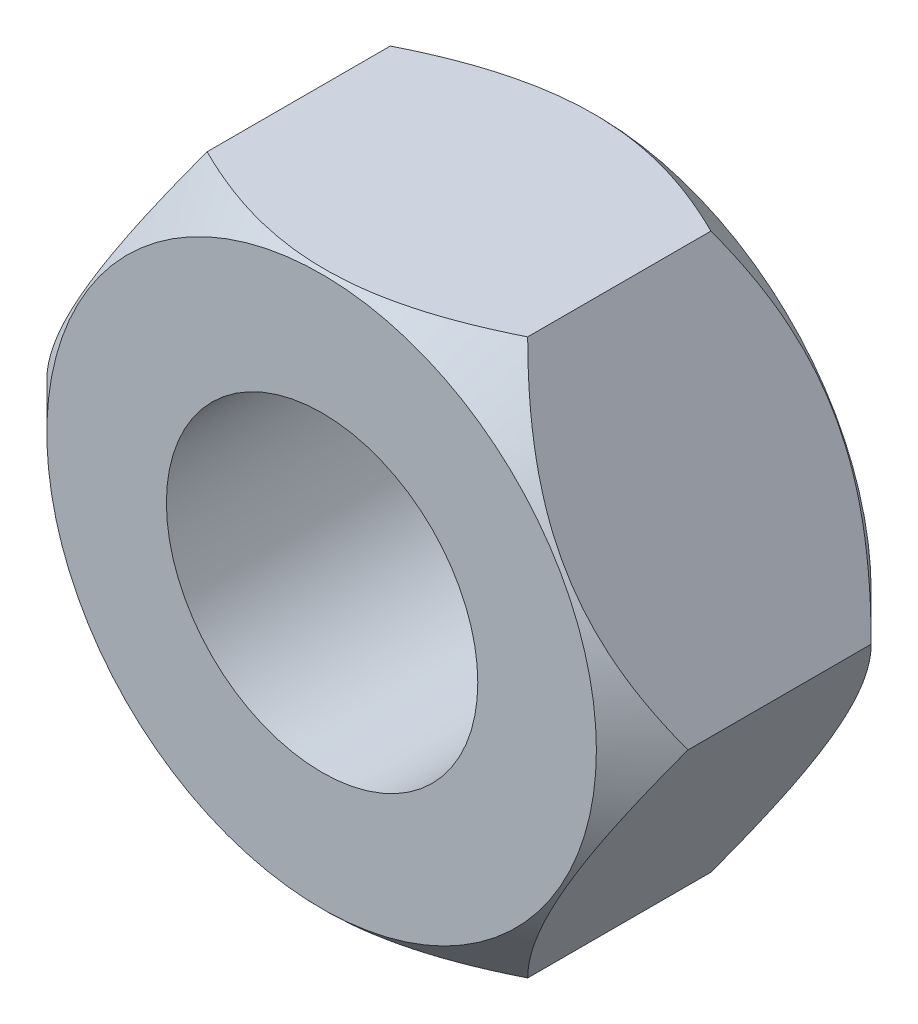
ISO-10303-21;
HEADER;
FILE_DESCRIPTION(('STEP AP214'),'2;1');
FILE_NAME('part.step','',(''),(''),'','','');
FILE_SCHEMA(('AUTOMOTIVE_DESIGN { 1 0 10303 214 1 1 1 1 }'));
ENDSEC;
DATA;
#1=APPLICATION_CONTEXT('core data for automotive mechanical design processes');
#2=APPLICATION_PROTOCOL_DEFINITION('international standard','automotive_design',2000,#1);
#3=PRODUCT_CONTEXT('',#1,'mechanical');
#4=PRODUCT('Part','Part','',(#3));
#5=PRODUCT_RELATED_PRODUCT_CATEGORY('part','',(#4));
#6=PRODUCT_DEFINITION_FORMATION('','',#4);
#7=PRODUCT_DEFINITION_CONTEXT('part definition',#1,'design');
#8=PRODUCT_DEFINITION('design','',#6,#7);
#9=PRODUCT_DEFINITION_SHAPE('','',#8);
#10=(LENGTH_UNIT() NAMED_UNIT(*) SI_UNIT(.MILLI.,.METRE.));
#11=(NAMED_UNIT(*) PLANE_ANGLE_UNIT() SI_UNIT($,.RADIAN.));
#12=(NAMED_UNIT(*) SI_UNIT($,.STERADIAN.) SOLID_ANGLE_UNIT());
#13=UNCERTAINTY_MEASURE_WITH_UNIT(LENGTH_MEASURE(1.E-05),#10,'distance_accuracy_value','');
#14=(GEOMETRIC_REPRESENTATION_CONTEXT(3) GLOBAL_UNCERTAINTY_ASSIGNED_CONTEXT((#13)) GLOBAL_UNIT_ASSIGNED_CONTEXT((#10,
#11,#12)) REPRESENTATION_CONTEXT('',''));
#15=CARTESIAN_POINT('',(0.,0.,0.));
#16=DIRECTION('',(0.,0.,1.));
#17=DIRECTION('',(1.,0.,0.));
#18=AXIS2_PLACEMENT_3D('',#15,#16,#17);
#19=CARTESIAN_POINT('',(0.,0.,1.));
#20=DIRECTION('',(0.,0.,1.));
#21=DIRECTION('',(1.,0.,0.));
#22=AXIS2_PLACEMENT_3D('',#19,#20,#21);
#23=CONICAL_SURFACE('',#22,7.,0.78539816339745);
#24=CARTESIAN_POINT('',(0.,0.,0.));
#25=DIRECTION('',(0.,0.,1.));
#26=DIRECTION('',(1.,0.,0.));
#27=AXIS2_PLACEMENT_3D('',#24,#25,#26);
#28=CIRCLE('',#27,5.99999999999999);
#29=CARTESIAN_POINT('',(5.99999999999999,0.,0.));
#30=VERTEX_POINT('',#29);
#31=EDGE_CURVE('E210',#30,#30,#28,.F.);
#32=ORIENTED_EDGE('',*,*,#31,.F.);
#33=EDGE_LOOP('',(#32));
#34=FACE_BOUND('',#33,.T.);
#35=CARTESIAN_POINT('',(3.49988452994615,6.06237782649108,1.00011547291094));
#36=CARTESIAN_POINT('',(3.56006472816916,5.95814266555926,0.93994132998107));
#37=CARTESIAN_POINT('',(3.62070750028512,5.85310630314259,0.881613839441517));
#38=CARTESIAN_POINT('',(3.74300894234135,5.64127399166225,0.769213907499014));
#39=CARTESIAN_POINT('',(3.80466814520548,5.53447711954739,0.715143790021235));
#40=CARTESIAN_POINT('',(3.99187934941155,5.21021780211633,0.559701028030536));
#41=CARTESIAN_POINT('',(4.1190161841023,4.99001034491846,0.465759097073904));
#42=CARTESIAN_POINT('',(4.37539777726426,4.54594439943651,0.304890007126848));
#43=CARTESIAN_POINT('',(4.5045770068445,4.32219941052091,0.237557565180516));
#44=CARTESIAN_POINT('',(4.70046959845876,3.98290348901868,0.159670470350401));
#45=CARTESIAN_POINT('',(4.76605553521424,3.86930531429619,0.137570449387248));
#46=CARTESIAN_POINT('',(4.89778273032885,3.64114711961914,0.10157436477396));
#47=CARTESIAN_POINT('',(4.96392390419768,3.52658724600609,0.0876770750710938));
#48=CARTESIAN_POINT('',(5.1251007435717,3.24742077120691,0.0643762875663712));
#49=CARTESIAN_POINT('',(5.22031007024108,3.08251338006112,0.0594873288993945));
#50=CARTESIAN_POINT('',(5.41055712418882,2.75299581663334,0.0676930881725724));
#51=CARTESIAN_POINT('',(5.50559477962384,2.58838576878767,0.0807941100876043));
#52=CARTESIAN_POINT('',(5.69477409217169,2.26071758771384,0.124207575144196));
#53=CARTESIAN_POINT('',(5.78891462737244,2.09766139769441,0.154539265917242));
#54=CARTESIAN_POINT('',(5.97557765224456,1.77435155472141,0.230765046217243));
#55=CARTESIAN_POINT('',(6.06810026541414,1.61409768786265,0.276657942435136));
#56=CARTESIAN_POINT('',(6.2323446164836,1.32961812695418,0.371073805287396));
#57=CARTESIAN_POINT('',(6.30443003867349,1.20476251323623,0.41711368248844));
#58=CARTESIAN_POINT('',(6.447306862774,0.957292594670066,0.516612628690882));
#59=CARTESIAN_POINT('',(6.51809822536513,0.834678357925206,0.57007192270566));
#60=CARTESIAN_POINT('',(6.65816396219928,0.592077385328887,0.683211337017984));
#61=CARTESIAN_POINT('',(6.72744231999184,0.472083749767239,0.742871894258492));
#62=CARTESIAN_POINT('',(6.86471619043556,0.23431843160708,0.867630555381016));
#63=CARTESIAN_POINT('',(6.93271245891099,0.116545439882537,0.93272532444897));
#64=CARTESIAN_POINT('',(7.00011547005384,-0.000200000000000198,1.00011547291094));
#65=B_SPLINE_CURVE_WITH_KNOTS('',3,(#35,#36,#37,#38,#39,#40,#41,#42,#43,#44,#45,#46,#47,#48,#49,
#50,#51,#52,#53,#54,#55,#56,#57,#58,#59,#60,#61,#62,#63,#64),.UNSPECIFIED.,.F.,.F.,(4,2,2,2,2,2,
2,2,2,2,2,2,2,2,4),(0.,0.403669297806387,0.807557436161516,1.61969420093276,2.41893497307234,
2.81777152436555,3.21654844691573,3.78710477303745,4.35786108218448,4.92925621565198,
5.50060754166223,5.95442549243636,6.40825720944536,6.8606983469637,7.31286384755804),.UNSPECIFIED.);
#66=CARTESIAN_POINT('',(3.49999999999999,6.06217782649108,1.));
#67=VERTEX_POINT('',#66);
#68=CARTESIAN_POINT('',(7.,0.,1.));
#69=VERTEX_POINT('',#68);
#70=EDGE_CURVE('E87',#67,#69,#65,.T.);
#71=ORIENTED_EDGE('',*,*,#70,.T.);
#72=CARTESIAN_POINT('',(7.00011547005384,0.0002,1.00011547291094));
#73=CARTESIAN_POINT('',(6.93993527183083,-0.104035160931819,0.939941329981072));
#74=CARTESIAN_POINT('',(6.87929249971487,-0.209071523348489,0.88161383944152));
#75=CARTESIAN_POINT('',(6.75699105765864,-0.420903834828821,0.76921390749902));
#76=CARTESIAN_POINT('',(6.69533185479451,-0.527700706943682,0.715143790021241));
#77=CARTESIAN_POINT('',(6.50812065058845,-0.851960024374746,0.559701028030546));
#78=CARTESIAN_POINT('',(6.3809838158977,-1.07216748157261,0.465759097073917));
#79=CARTESIAN_POINT('',(6.12460222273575,-1.51623342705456,0.304890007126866));
#80=CARTESIAN_POINT('',(5.99542299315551,-1.73997841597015,0.237557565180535));
#81=CARTESIAN_POINT('',(5.79953040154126,-2.07927433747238,0.159670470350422));
#82=CARTESIAN_POINT('',(5.73394446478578,-2.19287251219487,0.137570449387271));
#83=CARTESIAN_POINT('',(5.60221726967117,-2.42103070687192,0.101574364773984));
#84=CARTESIAN_POINT('',(5.53607609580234,-2.53559058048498,0.087677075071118));
#85=CARTESIAN_POINT('',(5.37489925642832,-2.81475705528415,0.0643762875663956));
#86=CARTESIAN_POINT('',(5.27968992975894,-2.97966444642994,0.0594873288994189));
#87=CARTESIAN_POINT('',(5.0894428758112,-3.30918200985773,0.0676930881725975));
#88=CARTESIAN_POINT('',(4.99440522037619,-3.4737920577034,0.0807941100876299));
#89=CARTESIAN_POINT('',(4.80522590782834,-3.80146023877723,0.124207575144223));
#90=CARTESIAN_POINT('',(4.71108537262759,-3.96451642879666,0.154539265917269));
#91=CARTESIAN_POINT('',(4.52442234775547,-4.28782627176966,0.230765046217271));
#92=CARTESIAN_POINT('',(4.43189973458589,-4.44808013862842,0.276657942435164));
#93=CARTESIAN_POINT('',(4.26765538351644,-4.73255969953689,0.371073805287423));
#94=CARTESIAN_POINT('',(4.19556996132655,-4.85741531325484,0.417113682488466));
#95=CARTESIAN_POINT('',(4.05269313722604,-5.10488523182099,0.516612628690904));
#96=CARTESIAN_POINT('',(3.98190177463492,-5.22749946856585,0.57007192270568));
#97=CARTESIAN_POINT('',(3.84183603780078,-5.47010044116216,0.683211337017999));
#98=CARTESIAN_POINT('',(3.77255768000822,-5.59009407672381,0.742871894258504));
#99=CARTESIAN_POINT('',(3.6352838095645,-5.82785939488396,0.867630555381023));
#100=CARTESIAN_POINT('',(3.56728754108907,-5.9456323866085,0.932725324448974));
#101=CARTESIAN_POINT('',(3.49988452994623,-6.06237782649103,1.00011547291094));
#102=B_SPLINE_CURVE_WITH_KNOTS('',3,(#72,#73,#74,#75,#76,#77,#78,#79,#80,#81,#82,#83,#84,#85,
#86,#87,#88,#89,#90,#91,#92,#93,#94,#95,#96,#97,#98,#99,#100,#101),.UNSPECIFIED.,.F.,.F.,(4,2,2,
2,2,2,2,2,2,2,2,2,2,2,4),(0.,0.403669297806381,0.807557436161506,1.61969420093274,
2.41893497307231,2.81777152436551,3.21654844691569,3.78710477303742,4.35786108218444,
4.92925621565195,5.5006075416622,5.95442549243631,6.4082572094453,6.86069834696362,
7.31286384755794),.UNSPECIFIED.);
#103=CARTESIAN_POINT('',(3.50000000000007,-6.06217782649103,1.));
#104=VERTEX_POINT('',#103);
#105=EDGE_CURVE('E176',#69,#104,#102,.T.);
#106=ORIENTED_EDGE('',*,*,#105,.T.);
#107=CARTESIAN_POINT('',(-7.27913594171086,-6.06217782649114,3.47289924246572));
#108=CARTESIAN_POINT('',(-7.10317834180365,-6.06217782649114,3.33772084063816));
#109=CARTESIAN_POINT('',(-6.92626980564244,-6.06217782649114,3.2037607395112));
#110=CARTESIAN_POINT('',(-6.57016320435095,-6.06217782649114,2.93883289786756));
#111=CARTESIAN_POINT('',(-6.39096460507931,-6.06217782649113,2.80786587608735));
#112=CARTESIAN_POINT('',(-6.02858041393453,-6.06217782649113,2.54854786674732));
#113=CARTESIAN_POINT('',(-5.84537472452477,-6.06217782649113,2.42022487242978));
#114=CARTESIAN_POINT('',(-5.47590939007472,-6.06217782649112,2.16806840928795));
#115=CARTESIAN_POINT('',(-5.2896499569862,-6.06217782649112,2.04423463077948));
#116=CARTESIAN_POINT('',(-4.90173360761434,-6.06217782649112,1.79445897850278));
#117=CARTESIAN_POINT('',(-4.69984526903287,-6.06217782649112,1.66887471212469));
#118=CARTESIAN_POINT('',(-4.29132923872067,-6.06217782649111,1.4255354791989));
#119=CARTESIAN_POINT('',(-4.08470076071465,-6.06217782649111,1.30778182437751));
#120=CARTESIAN_POINT('',(-3.66665369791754,-6.06217782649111,1.08261412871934));
#121=CARTESIAN_POINT('',(-3.45525159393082,-6.0621778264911,0.975169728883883));
#122=CARTESIAN_POINT('',(-3.02648683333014,-6.0621778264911,0.773027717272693));
#123=CARTESIAN_POINT('',(-2.80912703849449,-6.0621778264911,0.678324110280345));
#124=CARTESIAN_POINT('',(-2.38945676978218,-6.06217782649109,0.513524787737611));
#125=CARTESIAN_POINT('',(-2.18774056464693,-6.06217782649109,0.441931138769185));
#126=CARTESIAN_POINT('',(-1.77919044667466,-6.06217782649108,0.314892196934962));
#127=CARTESIAN_POINT('',(-1.5723562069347,-6.06217782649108,0.259447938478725));
#128=CARTESIAN_POINT('',(-1.15839482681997,-6.06217782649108,0.168624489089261));
#129=CARTESIAN_POINT('',(-0.951348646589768,-6.06217782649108,0.132882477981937));
#130=CARTESIAN_POINT('',(-0.534711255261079,-6.06217782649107,0.0822054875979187));
#131=CARTESIAN_POINT('',(-0.325120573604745,-6.06217782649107,0.0672662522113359));
#132=CARTESIAN_POINT('',(0.0854359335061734,-6.06217782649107,0.0594550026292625));
#133=CARTESIAN_POINT('',(0.286384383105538,-6.06217782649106,0.0656601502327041));
#134=CARTESIAN_POINT('',(0.686701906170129,-6.06217782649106,0.0976821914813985));
#135=CARTESIAN_POINT('',(0.886070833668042,-6.06217782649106,0.12350087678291));
#136=CARTESIAN_POINT('',(1.28516440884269,-6.06217782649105,0.193732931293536));
#137=CARTESIAN_POINT('',(1.4848304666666,-6.06217782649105,0.238473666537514));
#138=CARTESIAN_POINT('',(1.87976956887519,-6.06217782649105,0.344075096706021));
#139=CARTESIAN_POINT('',(2.07504287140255,-6.06217782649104,0.40493484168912));
#140=CARTESIAN_POINT('',(2.47244793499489,-6.06217782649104,0.544179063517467));
#141=CARTESIAN_POINT('',(2.67428375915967,-6.06217782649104,0.623398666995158));
#142=CARTESIAN_POINT('',(3.07276063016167,-6.06217782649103,0.794072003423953));
#143=CARTESIAN_POINT('',(3.26939928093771,-6.06217782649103,0.885531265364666));
#144=CARTESIAN_POINT('',(3.65841256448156,-6.06217782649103,1.07851459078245));
#145=CARTESIAN_POINT('',(3.85077167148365,-6.06217782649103,1.18006969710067));
#146=CARTESIAN_POINT('',(4.23108086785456,-6.06217782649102,1.39100920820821));
#147=CARTESIAN_POINT('',(4.41903163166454,-6.06217782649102,1.50039240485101));
#148=CARTESIAN_POINT('',(4.78191124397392,-6.06217782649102,1.71989981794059));
#149=CARTESIAN_POINT('',(4.95702469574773,-6.06217782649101,1.82972046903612));
#150=CARTESIAN_POINT('',(5.30424313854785,-6.06217782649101,2.05403278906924));
#151=CARTESIAN_POINT('',(5.47634790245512,-6.06217782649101,2.16852480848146));
#152=CARTESIAN_POINT('',(5.81655805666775,-6.06217782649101,2.40041373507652));
#153=CARTESIAN_POINT('',(5.98468447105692,-6.062177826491,2.5177799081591));
#154=CARTESIAN_POINT('',(6.31863136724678,-6.062177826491,2.75565578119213));
#155=CARTESIAN_POINT('',(6.48445247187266,-6.062177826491,2.87616460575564));
#156=CARTESIAN_POINT('',(6.64930664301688,-6.062177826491,2.99795970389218));
#157=B_SPLINE_CURVE_WITH_KNOTS('',3,(#107,#108,#109,#110,#111,#112,#113,#114,#115,#116,#117,
#118,#119,#120,#121,#122,#123,#124,#125,#126,#127,#128,#129,#130,#131,#132,#133,#134,#135,#136,
#137,#138,#139,#140,#141,#142,#143,#144,#145,#146,#147,#148,#149,#150,#151,#152,#153,#154,#155,
#156),.UNSPECIFIED.,.F.,.F.,(4,2,2,2,2,2,2,2,2,2,2,2,2,2,2,2,2,2,2,2,2,2,2,2,4),(0.,
0.6656762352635,1.33151067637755,2.00248421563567,2.67341138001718,3.38655327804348,
4.09981433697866,4.81090598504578,5.52166184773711,6.16324135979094,6.80486195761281,
7.43423460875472,8.06347847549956,8.66561730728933,9.26781114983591,9.88087949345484,
10.4939117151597,11.1438903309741,11.7941635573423,12.4465020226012,13.0987400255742,
13.7187560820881,14.3388187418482,14.9538989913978,15.5688097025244),.UNSPECIFIED.);
#158=CARTESIAN_POINT('',(-3.49999999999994,-6.0621778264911,1.));
#159=VERTEX_POINT('',#158);
#160=EDGE_CURVE('E170',#104,#159,#157,.F.);
#161=ORIENTED_EDGE('',*,*,#160,.T.);
#162=CARTESIAN_POINT('',(-3.49988452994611,-6.0623778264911,1.00011547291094));
#163=CARTESIAN_POINT('',(-3.56006472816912,-5.95814266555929,0.93994132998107));
#164=CARTESIAN_POINT('',(-3.62070750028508,-5.85310630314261,0.881613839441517));
#165=CARTESIAN_POINT('',(-3.74300894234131,-5.64127399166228,0.769213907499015));
#166=CARTESIAN_POINT('',(-3.80466814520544,-5.53447711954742,0.715143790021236));
#167=CARTESIAN_POINT('',(-3.99187934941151,-5.21021780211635,0.559701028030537));
#168=CARTESIAN_POINT('',(-4.11901618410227,-4.99001034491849,0.465759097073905));
#169=CARTESIAN_POINT('',(-4.37539777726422,-4.54594439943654,0.304890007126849));
#170=CARTESIAN_POINT('',(-4.50457700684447,-4.32219941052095,0.237557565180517));
#171=CARTESIAN_POINT('',(-4.70046959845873,-3.98290348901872,0.159670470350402));
#172=CARTESIAN_POINT('',(-4.76605553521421,-3.86930531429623,0.137570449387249));
#173=CARTESIAN_POINT('',(-4.89778273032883,-3.64114711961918,0.101574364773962));
#174=CARTESIAN_POINT('',(-4.96392390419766,-3.52658724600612,0.0876770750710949));
#175=CARTESIAN_POINT('',(-5.12510074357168,-3.24742077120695,0.064376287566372));
#176=CARTESIAN_POINT('',(-5.22031007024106,-3.08251338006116,0.0594873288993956));
#177=CARTESIAN_POINT('',(-5.4105571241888,-2.75299581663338,0.0676930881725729));
#178=CARTESIAN_POINT('',(-5.50559477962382,-2.58838576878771,0.0807941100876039));
#179=CARTESIAN_POINT('',(-5.69477409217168,-2.26071758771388,0.124207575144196));
#180=CARTESIAN_POINT('',(-5.78891462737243,-2.09766139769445,0.154539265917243));
#181=CARTESIAN_POINT('',(-5.97557765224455,-1.77435155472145,0.230765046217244));
#182=CARTESIAN_POINT('',(-6.06810026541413,-1.6140976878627,0.276657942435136));
#183=CARTESIAN_POINT('',(-6.23234461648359,-1.32961812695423,0.371073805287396));
#184=CARTESIAN_POINT('',(-6.30443003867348,-1.20476251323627,0.41711368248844));
#185=CARTESIAN_POINT('',(-6.44730686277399,-0.957292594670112,0.516612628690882));
#186=CARTESIAN_POINT('',(-6.51809822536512,-0.834678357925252,0.57007192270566));
#187=CARTESIAN_POINT('',(-6.65816396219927,-0.592077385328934,0.683211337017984));
#188=CARTESIAN_POINT('',(-6.72744231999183,-0.472083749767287,0.742871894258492));
#189=CARTESIAN_POINT('',(-6.86471619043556,-0.234318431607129,0.867630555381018));
#190=CARTESIAN_POINT('',(-6.93271245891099,-0.116545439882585,0.932725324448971));
#191=CARTESIAN_POINT('',(-7.00011547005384,0.000199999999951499,1.00011547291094));
#192=B_SPLINE_CURVE_WITH_KNOTS('',3,(#162,#163,#164,#165,#166,#167,#168,#169,#170,#171,#172,
#173,#174,#175,#176,#177,#178,#179,#180,#181,#182,#183,#184,#185,#186,#187,#188,#189,#190,#191),
.UNSPECIFIED.,.F.,.F.,(4,2,2,2,2,2,2,2,2,2,2,2,2,2,4),(0.,0.403669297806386,0.807557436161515,
1.61969420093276,2.41893497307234,2.81777152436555,3.21654844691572,3.78710477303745,
4.35786108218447,4.92925621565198,5.50060754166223,5.95442549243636,6.40825720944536,
6.8606983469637,7.31286384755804),.UNSPECIFIED.);
#193=CARTESIAN_POINT('',(-7.,0.,1.));
#194=VERTEX_POINT('',#193);
#195=EDGE_CURVE('E108',#159,#194,#192,.T.);
#196=ORIENTED_EDGE('',*,*,#195,.T.);
#197=CARTESIAN_POINT('',(-7.00011547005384,-0.000200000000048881,1.00011547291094));
#198=CARTESIAN_POINT('',(-6.93993527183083,0.104035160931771,0.93994132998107));
#199=CARTESIAN_POINT('',(-6.87929249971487,0.209071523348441,0.881613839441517));
#200=CARTESIAN_POINT('',(-6.75699105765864,0.420903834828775,0.769213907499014));
#201=CARTESIAN_POINT('',(-6.69533185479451,0.527700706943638,0.715143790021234));
#202=CARTESIAN_POINT('',(-6.50812065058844,0.851960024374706,0.559701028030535));
#203=CARTESIAN_POINT('',(-6.38098381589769,1.07216748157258,0.465759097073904));
#204=CARTESIAN_POINT('',(-6.12460222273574,1.51623342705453,0.304890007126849));
#205=CARTESIAN_POINT('',(-5.9954229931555,1.73997841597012,0.237557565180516));
#206=CARTESIAN_POINT('',(-5.79953040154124,2.07927433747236,0.1596704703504));
#207=CARTESIAN_POINT('',(-5.73394446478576,2.19287251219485,0.137570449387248));
#208=CARTESIAN_POINT('',(-5.60221726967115,2.4210307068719,0.10157436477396));
#209=CARTESIAN_POINT('',(-5.53607609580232,2.53559058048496,0.0876770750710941));
#210=CARTESIAN_POINT('',(-5.3748992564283,2.81475705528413,0.0643762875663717));
#211=CARTESIAN_POINT('',(-5.27968992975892,2.97966444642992,0.0594873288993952));
#212=CARTESIAN_POINT('',(-5.08944287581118,3.30918200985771,0.0676930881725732));
#213=CARTESIAN_POINT('',(-4.99440522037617,3.47379205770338,0.0807941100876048));
#214=CARTESIAN_POINT('',(-4.80522590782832,3.80146023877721,0.124207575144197));
#215=CARTESIAN_POINT('',(-4.71108537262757,3.96451642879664,0.154539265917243));
#216=CARTESIAN_POINT('',(-4.52442234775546,4.28782627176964,0.230765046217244));
#217=CARTESIAN_POINT('',(-4.43189973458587,4.4480801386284,0.276657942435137));
#218=CARTESIAN_POINT('',(-4.26765538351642,4.73255969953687,0.371073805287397));
#219=CARTESIAN_POINT('',(-4.19556996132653,4.85741531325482,0.417113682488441));
#220=CARTESIAN_POINT('',(-4.05269313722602,5.10488523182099,0.516612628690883));
#221=CARTESIAN_POINT('',(-3.9819017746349,5.22749946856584,0.570071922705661));
#222=CARTESIAN_POINT('',(-3.84183603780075,5.47010044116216,0.683211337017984));
#223=CARTESIAN_POINT('',(-3.77255768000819,5.59009407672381,0.742871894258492));
#224=CARTESIAN_POINT('',(-3.63528380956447,5.82785939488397,0.867630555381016));
#225=CARTESIAN_POINT('',(-3.56728754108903,5.94563238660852,0.93272532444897));
#226=CARTESIAN_POINT('',(-3.49988452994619,6.06237782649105,1.00011547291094));
#227=B_SPLINE_CURVE_WITH_KNOTS('',3,(#197,#198,#199,#200,#201,#202,#203,#204,#205,#206,#207,
#208,#209,#210,#211,#212,#213,#214,#215,#216,#217,#218,#219,#220,#221,#222,#223,#224,#225,#226),
.UNSPECIFIED.,.F.,.F.,(4,2,2,2,2,2,2,2,2,2,2,2,2,2,4),(0.,0.403669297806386,0.807557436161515,
1.61969420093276,2.41893497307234,2.81777152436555,3.21654844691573,3.78710477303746,
4.35786108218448,4.92925621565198,5.50060754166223,5.95442549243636,6.40825720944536,
6.86069834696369,7.31286384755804),.UNSPECIFIED.);
#228=CARTESIAN_POINT('',(-3.50000000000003,6.06217782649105,1.));
#229=VERTEX_POINT('',#228);
#230=EDGE_CURVE('E106',#194,#229,#227,.T.);
#231=ORIENTED_EDGE('',*,*,#230,.T.);
#232=CARTESIAN_POINT('',(-7.27913594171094,6.06217782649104,3.47289924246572));
#233=CARTESIAN_POINT('',(-7.10317834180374,6.06217782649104,3.33772084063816));
#234=CARTESIAN_POINT('',(-6.92626980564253,6.06217782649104,3.2037607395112));
#235=CARTESIAN_POINT('',(-6.57016320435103,6.06217782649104,2.93883289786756));
#236=CARTESIAN_POINT('',(-6.39096460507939,6.06217782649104,2.80786587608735));
#237=CARTESIAN_POINT('',(-6.02858041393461,6.06217782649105,2.54854786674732));
#238=CARTESIAN_POINT('',(-5.84537472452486,6.06217782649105,2.42022487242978));
#239=CARTESIAN_POINT('',(-5.47590939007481,6.06217782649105,2.16806840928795));
#240=CARTESIAN_POINT('',(-5.28964995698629,6.06217782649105,2.04423463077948));
#241=CARTESIAN_POINT('',(-4.90173360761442,6.06217782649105,1.79445897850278));
#242=CARTESIAN_POINT('',(-4.69984526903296,6.06217782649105,1.66887471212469));
#243=CARTESIAN_POINT('',(-4.29132923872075,6.06217782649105,1.4255354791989));
#244=CARTESIAN_POINT('',(-4.08470076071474,6.06217782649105,1.30778182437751));
#245=CARTESIAN_POINT('',(-3.66665369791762,6.06217782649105,1.08261412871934));
#246=CARTESIAN_POINT('',(-3.45525159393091,6.06217782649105,0.975169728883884));
#247=CARTESIAN_POINT('',(-3.02648683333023,6.06217782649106,0.773027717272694));
#248=CARTESIAN_POINT('',(-2.80912703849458,6.06217782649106,0.678324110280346));
#249=CARTESIAN_POINT('',(-2.38945676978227,6.06217782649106,0.513524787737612));
#250=CARTESIAN_POINT('',(-2.18774056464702,6.06217782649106,0.441931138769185));
#251=CARTESIAN_POINT('',(-1.77919044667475,6.06217782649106,0.314892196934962));
#252=CARTESIAN_POINT('',(-1.57235620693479,6.06217782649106,0.259447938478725));
#253=CARTESIAN_POINT('',(-1.15839482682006,6.06217782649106,0.168624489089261));
#254=CARTESIAN_POINT('',(-0.951348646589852,6.06217782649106,0.132882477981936));
#255=CARTESIAN_POINT('',(-0.534711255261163,6.06217782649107,0.082205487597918));
#256=CARTESIAN_POINT('',(-0.325120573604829,6.06217782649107,0.0672662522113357));
#257=CARTESIAN_POINT('',(0.0854359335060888,6.06217782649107,0.0594550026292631));
#258=CARTESIAN_POINT('',(0.286384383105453,6.06217782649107,0.0656601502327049));
#259=CARTESIAN_POINT('',(0.686701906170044,6.06217782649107,0.0976821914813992));
#260=CARTESIAN_POINT('',(0.886070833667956,6.06217782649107,0.12350087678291));
#261=CARTESIAN_POINT('',(1.28516440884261,6.06217782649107,0.193732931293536));
#262=CARTESIAN_POINT('',(1.48483046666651,6.06217782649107,0.238473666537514));
#263=CARTESIAN_POINT('',(1.8797695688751,6.06217782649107,0.344075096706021));
#264=CARTESIAN_POINT('',(2.07504287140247,6.06217782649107,0.40493484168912));
#265=CARTESIAN_POINT('',(2.47244793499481,6.06217782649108,0.544179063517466));
#266=CARTESIAN_POINT('',(2.67428375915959,6.06217782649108,0.623398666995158));
#267=CARTESIAN_POINT('',(3.07276063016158,6.06217782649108,0.794072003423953));
#268=CARTESIAN_POINT('',(3.26939928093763,6.06217782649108,0.885531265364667));
#269=CARTESIAN_POINT('',(3.65841256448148,6.06217782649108,1.07851459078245));
#270=CARTESIAN_POINT('',(3.85077167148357,6.06217782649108,1.18006969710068));
#271=CARTESIAN_POINT('',(4.23108086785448,6.06217782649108,1.39100920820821));
#272=CARTESIAN_POINT('',(4.41903163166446,6.06217782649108,1.50039240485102));
#273=CARTESIAN_POINT('',(4.78191124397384,6.06217782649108,1.7198998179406));
#274=CARTESIAN_POINT('',(4.95702469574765,6.06217782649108,1.82972046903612));
#275=CARTESIAN_POINT('',(5.30424313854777,6.06217782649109,2.05403278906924));
#276=CARTESIAN_POINT('',(5.47634790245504,6.06217782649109,2.16852480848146));
#277=CARTESIAN_POINT('',(5.81655805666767,6.06217782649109,2.40041373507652));
#278=CARTESIAN_POINT('',(5.98468447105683,6.06217782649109,2.5177799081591));
#279=CARTESIAN_POINT('',(6.3186313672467,6.06217782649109,2.75565578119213));
#280=CARTESIAN_POINT('',(6.48445247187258,6.06217782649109,2.87616460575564));
#281=CARTESIAN_POINT('',(6.6493066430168,6.06217782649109,2.99795970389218));
#282=B_SPLINE_CURVE_WITH_KNOTS('',3,(#232,#233,#234,#235,#236,#237,#238,#239,#240,#241,#242,
#243,#244,#245,#246,#247,#248,#249,#250,#251,#252,#253,#254,#255,#256,#257,#258,#259,#260,#261,
#262,#263,#264,#265,#266,#267,#268,#269,#270,#271,#272,#273,#274,#275,#276,#277,#278,#279,#280,
#281),.UNSPECIFIED.,.F.,.F.,(4,2,2,2,2,2,2,2,2,2,2,2,2,2,2,2,2,2,2,2,2,2,2,2,4),(0.,
0.665676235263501,1.33151067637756,2.00248421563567,2.67341138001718,3.38655327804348,
4.09981433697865,4.81090598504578,5.52166184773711,6.16324135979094,6.80486195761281,
7.43423460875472,8.06347847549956,8.66561730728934,9.26781114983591,9.88087949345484,
10.4939117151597,11.1438903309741,11.7941635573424,12.4465020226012,13.0987400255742,
13.7187560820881,14.3388187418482,14.9538989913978,15.5688097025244),.UNSPECIFIED.);
#283=EDGE_CURVE('E92',#229,#67,#282,.T.);
#284=ORIENTED_EDGE('',*,*,#283,.T.);
#285=EDGE_LOOP('',(#71,#106,#161,#196,#231,#284));
#286=FACE_BOUND('',#285,.T.);
#287=ADVANCED_FACE('F32',(#34,#286),#23,.T.);
#288=CARTESIAN_POINT('',(0.,0.,6.));
#289=DIRECTION('',(0.,0.,-1.));
#290=DIRECTION('',(-1.,0.,0.));
#291=AXIS2_PLACEMENT_3D('',#288,#289,#290);
#292=CONICAL_SURFACE('',#291,5.99999999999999,0.785398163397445);
#293=CARTESIAN_POINT('',(0.,0.,6.));
#294=DIRECTION('',(0.,0.,1.));
#295=DIRECTION('',(1.,0.,0.));
#296=AXIS2_PLACEMENT_3D('',#293,#294,#295);
#297=CIRCLE('',#296,5.99999999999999);
#298=CARTESIAN_POINT('',(5.99999999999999,0.,6.));
#299=VERTEX_POINT('',#298);
#300=EDGE_CURVE('E211',#299,#299,#297,.T.);
#301=ORIENTED_EDGE('',*,*,#300,.F.);
#302=EDGE_LOOP('',(#301));
#303=FACE_BOUND('',#302,.T.);
#304=CARTESIAN_POINT('',(-7.27913594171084,-6.06217782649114,2.52710075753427));
#305=CARTESIAN_POINT('',(-7.10317834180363,-6.06217782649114,2.66227915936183));
#306=CARTESIAN_POINT('',(-6.92626980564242,-6.06217782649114,2.79623926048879));
#307=CARTESIAN_POINT('',(-6.57016320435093,-6.06217782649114,3.06116710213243));
#308=CARTESIAN_POINT('',(-6.39096460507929,-6.06217782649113,3.19213412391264));
#309=CARTESIAN_POINT('',(-6.02858041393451,-6.06217782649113,3.45145213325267));
#310=CARTESIAN_POINT('',(-5.84537472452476,-6.06217782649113,3.57977512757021));
#311=CARTESIAN_POINT('',(-5.47590939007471,-6.06217782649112,3.83193159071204));
#312=CARTESIAN_POINT('',(-5.28964995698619,-6.06217782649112,3.95576536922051));
#313=CARTESIAN_POINT('',(-4.90173360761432,-6.06217782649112,4.20554102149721));
#314=CARTESIAN_POINT('',(-4.69984526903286,-6.06217782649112,4.33112528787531));
#315=CARTESIAN_POINT('',(-4.29132923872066,-6.06217782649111,4.57446452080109));
#316=CARTESIAN_POINT('',(-4.08470076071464,-6.06217782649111,4.69221817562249));
#317=CARTESIAN_POINT('',(-3.66665369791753,-6.06217782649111,4.91738587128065));
#318=CARTESIAN_POINT('',(-3.45525159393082,-6.0621778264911,5.02483027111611));
#319=CARTESIAN_POINT('',(-3.02648683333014,-6.0621778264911,5.2269722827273));
#320=CARTESIAN_POINT('',(-2.80912703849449,-6.0621778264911,5.32167588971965));
#321=CARTESIAN_POINT('',(-2.38945676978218,-6.06217782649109,5.48647521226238));
#322=CARTESIAN_POINT('',(-2.18774056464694,-6.06217782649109,5.55806886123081));
#323=CARTESIAN_POINT('',(-1.77919044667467,-6.06217782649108,5.68510780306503));
#324=CARTESIAN_POINT('',(-1.57235620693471,-6.06217782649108,5.74055206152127));
#325=CARTESIAN_POINT('',(-1.15839482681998,-6.06217782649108,5.83137551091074));
#326=CARTESIAN_POINT('',(-0.951348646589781,-6.06217782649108,5.86711752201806));
#327=CARTESIAN_POINT('',(-0.534711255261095,-6.06217782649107,5.91779451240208));
#328=CARTESIAN_POINT('',(-0.325120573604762,-6.06217782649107,5.93273374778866));
#329=CARTESIAN_POINT('',(0.0854359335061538,-6.06217782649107,5.94054499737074));
#330=CARTESIAN_POINT('',(0.286384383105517,-6.06217782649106,5.9343398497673));
#331=CARTESIAN_POINT('',(0.686701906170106,-6.06217782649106,5.9023178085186));
#332=CARTESIAN_POINT('',(0.886070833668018,-6.06217782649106,5.87649912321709));
#333=CARTESIAN_POINT('',(1.28516440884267,-6.06217782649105,5.80626706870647));
#334=CARTESIAN_POINT('',(1.48483046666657,-6.06217782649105,5.76152633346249));
#335=CARTESIAN_POINT('',(1.87976956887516,-6.06217782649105,5.65592490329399));
#336=CARTESIAN_POINT('',(2.07504287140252,-6.06217782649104,5.59506515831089));
#337=CARTESIAN_POINT('',(2.47244793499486,-6.06217782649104,5.45582093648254));
#338=CARTESIAN_POINT('',(2.67428375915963,-6.06217782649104,5.37660133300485));
#339=CARTESIAN_POINT('',(3.07276063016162,-6.06217782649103,5.20592799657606));
#340=CARTESIAN_POINT('',(3.26939928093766,-6.06217782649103,5.11446873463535));
#341=CARTESIAN_POINT('',(3.6584125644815,-6.06217782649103,4.92148540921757));
#342=CARTESIAN_POINT('',(3.85077167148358,-6.06217782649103,4.81993030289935));
#343=CARTESIAN_POINT('',(4.23108086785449,-6.06217782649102,4.60899079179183));
#344=CARTESIAN_POINT('',(4.41903163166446,-6.06217782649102,4.49960759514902));
#345=CARTESIAN_POINT('',(4.78191124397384,-6.06217782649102,4.28010018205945));
#346=CARTESIAN_POINT('',(4.95702469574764,-6.06217782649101,4.17027953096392));
#347=CARTESIAN_POINT('',(5.30424313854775,-6.06217782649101,3.94596721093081));
#348=CARTESIAN_POINT('',(5.47634790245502,-6.06217782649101,3.83147519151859));
#349=CARTESIAN_POINT('',(5.81655805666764,-6.06217782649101,3.59958626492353));
#350=CARTESIAN_POINT('',(5.9846844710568,-6.062177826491,3.48222009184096));
#351=CARTESIAN_POINT('',(6.31863136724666,-6.062177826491,3.24434421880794));
#352=CARTESIAN_POINT('',(6.48445247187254,-6.062177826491,3.12383539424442));
#353=CARTESIAN_POINT('',(6.64930664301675,-6.062177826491,3.00204029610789));
#354=B_SPLINE_CURVE_WITH_KNOTS('',3,(#304,#305,#306,#307,#308,#309,#310,#311,#312,#313,#314,
#315,#316,#317,#318,#319,#320,#321,#322,#323,#324,#325,#326,#327,#328,#329,#330,#331,#332,#333,
#334,#335,#336,#337,#338,#339,#340,#341,#342,#343,#344,#345,#346,#347,#348,#349,#350,#351,#352,
#353),.UNSPECIFIED.,.F.,.F.,(4,2,2,2,2,2,2,2,2,2,2,2,2,2,2,2,2,2,2,2,2,2,2,2,4),(0.,
0.665676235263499,1.33151067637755,2.00248421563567,2.67341138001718,3.38655327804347,
4.09981433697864,4.81090598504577,5.52166184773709,6.16324135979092,6.80486195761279,
7.43423460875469,8.06347847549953,8.6656173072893,9.26781114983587,9.8808794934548,
10.4939117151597,11.143890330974,11.7941635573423,12.4465020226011,13.0987400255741,
13.718756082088,14.338818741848,14.9538989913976,15.5688097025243),.UNSPECIFIED.);
#355=CARTESIAN_POINT('',(-3.49999999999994,-6.0621778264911,4.99999999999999));
#356=VERTEX_POINT('',#355);
#357=CARTESIAN_POINT('',(3.50000000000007,-6.06217782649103,4.99999999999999));
#358=VERTEX_POINT('',#357);
#359=EDGE_CURVE('E45',#356,#358,#354,.T.);
#360=ORIENTED_EDGE('',*,*,#359,.T.);
#361=CARTESIAN_POINT('',(3.49988452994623,-6.06237782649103,4.99988452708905));
#362=CARTESIAN_POINT('',(3.56006472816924,-5.95814266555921,5.06005867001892));
#363=CARTESIAN_POINT('',(3.6207075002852,-5.85310630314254,5.11838616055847));
#364=CARTESIAN_POINT('',(3.74300894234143,-5.64127399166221,5.23078609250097));
#365=CARTESIAN_POINT('',(3.80466814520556,-5.53447711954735,5.28485620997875));
#366=CARTESIAN_POINT('',(3.99187934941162,-5.21021780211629,5.44029897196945));
#367=CARTESIAN_POINT('',(4.11901618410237,-4.99001034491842,5.53424090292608));
#368=CARTESIAN_POINT('',(4.37539777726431,-4.54594439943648,5.69510999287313));
#369=CARTESIAN_POINT('',(4.50457700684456,-4.32219941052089,5.76244243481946));
#370=CARTESIAN_POINT('',(4.70046959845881,-3.98290348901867,5.84032952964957));
#371=CARTESIAN_POINT('',(4.76605553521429,-3.86930531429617,5.86242955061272));
#372=CARTESIAN_POINT('',(4.89778273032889,-3.64114711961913,5.89842563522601));
#373=CARTESIAN_POINT('',(4.96392390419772,-3.52658724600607,5.91232292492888));
#374=CARTESIAN_POINT('',(5.12510074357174,-3.2474207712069,5.9356237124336));
#375=CARTESIAN_POINT('',(5.22031007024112,-3.08251338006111,5.94051267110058));
#376=CARTESIAN_POINT('',(5.41055712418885,-2.75299581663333,5.9323069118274));
#377=CARTESIAN_POINT('',(5.50559477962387,-2.58838576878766,5.91920588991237));
#378=CARTESIAN_POINT('',(5.69477409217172,-2.26071758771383,5.87579242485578));
#379=CARTESIAN_POINT('',(5.78891462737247,-2.0976613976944,5.84546073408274));
#380=CARTESIAN_POINT('',(5.97557765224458,-1.77435155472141,5.76923495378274));
#381=CARTESIAN_POINT('',(6.06810026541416,-1.61409768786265,5.72334205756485));
#382=CARTESIAN_POINT('',(6.23234461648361,-1.32961812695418,5.62892619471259));
#383=CARTESIAN_POINT('',(6.30443003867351,-1.20476251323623,5.58288631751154));
#384=CARTESIAN_POINT('',(6.44730686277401,-0.957292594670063,5.4833873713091));
#385=CARTESIAN_POINT('',(6.51809822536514,-0.834678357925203,5.42992807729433));
#386=CARTESIAN_POINT('',(6.65816396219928,-0.592077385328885,5.316788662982));
#387=CARTESIAN_POINT('',(6.72744231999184,-0.472083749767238,5.2571281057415));
#388=CARTESIAN_POINT('',(6.86471619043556,-0.23431843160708,5.13236944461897));
#389=CARTESIAN_POINT('',(6.932712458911,-0.116545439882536,5.06727467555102));
#390=CARTESIAN_POINT('',(7.00011547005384,0.000200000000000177,4.99988452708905));
#391=B_SPLINE_CURVE_WITH_KNOTS('',3,(#361,#362,#363,#364,#365,#366,#367,#368,#369,#370,#371,
#372,#373,#374,#375,#376,#377,#378,#379,#380,#381,#382,#383,#384,#385,#386,#387,#388,#389,#390),
.UNSPECIFIED.,.F.,.F.,(4,2,2,2,2,2,2,2,2,2,2,2,2,2,4),(0.,0.403669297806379,0.807557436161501,
1.61969420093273,2.41893497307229,2.8177715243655,3.21654844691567,3.78710477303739,
4.35786108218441,4.92925621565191,5.50060754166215,5.95442549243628,6.40825720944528,
6.86069834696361,7.31286384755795),.UNSPECIFIED.);
#392=CARTESIAN_POINT('',(7.,0.,4.99999999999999));
#393=VERTEX_POINT('',#392);
#394=EDGE_CURVE('E12',#358,#393,#391,.T.);
#395=ORIENTED_EDGE('',*,*,#394,.T.);
#396=CARTESIAN_POINT('',(7.00011547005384,-0.00020000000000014,4.99988452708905));
#397=CARTESIAN_POINT('',(6.93993527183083,0.104035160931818,5.06005867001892));
#398=CARTESIAN_POINT('',(6.87929249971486,0.209071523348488,5.11838616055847));
#399=CARTESIAN_POINT('',(6.75699105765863,0.42090383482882,5.23078609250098));
#400=CARTESIAN_POINT('',(6.69533185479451,0.527700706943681,5.28485620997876));
#401=CARTESIAN_POINT('',(6.50812065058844,0.851960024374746,5.44029897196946));
#402=CARTESIAN_POINT('',(6.38098381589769,1.07216748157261,5.53424090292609));
#403=CARTESIAN_POINT('',(6.12460222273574,1.51623342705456,5.69510999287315));
#404=CARTESIAN_POINT('',(5.99542299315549,1.73997841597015,5.76244243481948));
#405=CARTESIAN_POINT('',(5.79953040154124,2.07927433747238,5.84032952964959));
#406=CARTESIAN_POINT('',(5.73394446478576,2.19287251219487,5.86242955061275));
#407=CARTESIAN_POINT('',(5.60221726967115,2.42103070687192,5.89842563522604));
#408=CARTESIAN_POINT('',(5.53607609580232,2.53559058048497,5.9123229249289));
#409=CARTESIAN_POINT('',(5.3748992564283,2.81475705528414,5.93562371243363));
#410=CARTESIAN_POINT('',(5.27968992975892,2.97966444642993,5.9405126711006));
#411=CARTESIAN_POINT('',(5.08944287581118,3.30918200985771,5.93230691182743));
#412=CARTESIAN_POINT('',(4.99440522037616,3.47379205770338,5.9192058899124));
#413=CARTESIAN_POINT('',(4.80522590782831,3.80146023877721,5.87579242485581));
#414=CARTESIAN_POINT('',(4.71108537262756,3.96451642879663,5.84546073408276));
#415=CARTESIAN_POINT('',(4.52442234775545,4.28782627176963,5.76923495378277));
#416=CARTESIAN_POINT('',(4.43189973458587,4.44808013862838,5.72334205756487));
#417=CARTESIAN_POINT('',(4.26765538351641,4.73255969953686,5.62892619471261));
#418=CARTESIAN_POINT('',(4.19556996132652,4.85741531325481,5.58288631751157));
#419=CARTESIAN_POINT('',(4.052693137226,5.10488523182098,5.48338737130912));
#420=CARTESIAN_POINT('',(3.98190177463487,5.22749946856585,5.42992807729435));
#421=CARTESIAN_POINT('',(3.84183603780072,5.47010044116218,5.31678866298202));
#422=CARTESIAN_POINT('',(3.77255768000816,5.59009407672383,5.25712810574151));
#423=CARTESIAN_POINT('',(3.63528380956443,5.82785939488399,5.13236944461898));
#424=CARTESIAN_POINT('',(3.56728754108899,5.94563238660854,5.06727467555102));
#425=CARTESIAN_POINT('',(3.49988452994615,6.06237782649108,4.99988452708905));
#426=B_SPLINE_CURVE_WITH_KNOTS('',3,(#396,#397,#398,#399,#400,#401,#402,#403,#404,#405,#406,
#407,#408,#409,#410,#411,#412,#413,#414,#415,#416,#417,#418,#419,#420,#421,#422,#423,#424,#425),
.UNSPECIFIED.,.F.,.F.,(4,2,2,2,2,2,2,2,2,2,2,2,2,2,4),(0.,0.403669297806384,0.807557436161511,
1.61969420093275,2.41893497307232,2.81777152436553,3.2165484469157,3.78710477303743,
4.35786108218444,4.92925621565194,5.50060754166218,5.95442549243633,6.40825720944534,
6.86069834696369,7.31286384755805),.UNSPECIFIED.);
#427=CARTESIAN_POINT('',(3.49999999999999,6.06217782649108,4.99999999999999));
#428=VERTEX_POINT('',#427);
#429=EDGE_CURVE('E140',#393,#428,#426,.T.);
#430=ORIENTED_EDGE('',*,*,#429,.T.);
#431=CARTESIAN_POINT('',(-7.27913594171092,6.06217782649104,2.52710075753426));
#432=CARTESIAN_POINT('',(-7.10317834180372,6.06217782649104,2.66227915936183));
#433=CARTESIAN_POINT('',(-6.92626980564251,6.06217782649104,2.79623926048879));
#434=CARTESIAN_POINT('',(-6.57016320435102,6.06217782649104,3.06116710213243));
#435=CARTESIAN_POINT('',(-6.39096460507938,6.06217782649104,3.19213412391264));
#436=CARTESIAN_POINT('',(-6.02858041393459,6.06217782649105,3.45145213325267));
#437=CARTESIAN_POINT('',(-5.84537472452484,6.06217782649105,3.57977512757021));
#438=CARTESIAN_POINT('',(-5.47590939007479,6.06217782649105,3.83193159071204));
#439=CARTESIAN_POINT('',(-5.28964995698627,6.06217782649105,3.95576536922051));
#440=CARTESIAN_POINT('',(-4.90173360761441,6.06217782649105,4.20554102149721));
#441=CARTESIAN_POINT('',(-4.69984526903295,6.06217782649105,4.33112528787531));
#442=CARTESIAN_POINT('',(-4.29132923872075,6.06217782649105,4.57446452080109));
#443=CARTESIAN_POINT('',(-4.08470076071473,6.06217782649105,4.69221817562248));
#444=CARTESIAN_POINT('',(-3.66665369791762,6.06217782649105,4.91738587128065));
#445=CARTESIAN_POINT('',(-3.4552515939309,6.06217782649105,5.02483027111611));
#446=CARTESIAN_POINT('',(-3.02648683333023,6.06217782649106,5.2269722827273));
#447=CARTESIAN_POINT('',(-2.80912703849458,6.06217782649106,5.32167588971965));
#448=CARTESIAN_POINT('',(-2.38945676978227,6.06217782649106,5.48647521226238));
#449=CARTESIAN_POINT('',(-2.18774056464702,6.06217782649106,5.55806886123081));
#450=CARTESIAN_POINT('',(-1.77919044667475,6.06217782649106,5.68510780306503));
#451=CARTESIAN_POINT('',(-1.57235620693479,6.06217782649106,5.74055206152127));
#452=CARTESIAN_POINT('',(-1.15839482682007,6.06217782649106,5.83137551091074));
#453=CARTESIAN_POINT('',(-0.951348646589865,6.06217782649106,5.86711752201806));
#454=CARTESIAN_POINT('',(-0.53471125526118,6.06217782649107,5.91779451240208));
#455=CARTESIAN_POINT('',(-0.325120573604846,6.06217782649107,5.93273374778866));
#456=CARTESIAN_POINT('',(0.0854359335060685,6.06217782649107,5.94054499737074));
#457=CARTESIAN_POINT('',(0.286384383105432,6.06217782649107,5.9343398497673));
#458=CARTESIAN_POINT('',(0.68670190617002,6.06217782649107,5.9023178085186));
#459=CARTESIAN_POINT('',(0.886070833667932,6.06217782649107,5.87649912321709));
#460=CARTESIAN_POINT('',(1.28516440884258,6.06217782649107,5.80626706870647));
#461=CARTESIAN_POINT('',(1.48483046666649,6.06217782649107,5.76152633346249));
#462=CARTESIAN_POINT('',(1.87976956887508,6.06217782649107,5.65592490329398));
#463=CARTESIAN_POINT('',(2.07504287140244,6.06217782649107,5.59506515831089));
#464=CARTESIAN_POINT('',(2.47244793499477,6.06217782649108,5.45582093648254));
#465=CARTESIAN_POINT('',(2.67428375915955,6.06217782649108,5.37660133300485));
#466=CARTESIAN_POINT('',(3.07276063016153,6.06217782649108,5.20592799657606));
#467=CARTESIAN_POINT('',(3.26939928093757,6.06217782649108,5.11446873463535));
#468=CARTESIAN_POINT('',(3.65841256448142,6.06217782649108,4.92148540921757));
#469=CARTESIAN_POINT('',(3.8507716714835,6.06217782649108,4.81993030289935));
#470=CARTESIAN_POINT('',(4.2310808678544,6.06217782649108,4.60899079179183));
#471=CARTESIAN_POINT('',(4.41903163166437,6.06217782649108,4.49960759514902));
#472=CARTESIAN_POINT('',(4.78191124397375,6.06217782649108,4.28010018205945));
#473=CARTESIAN_POINT('',(4.95702469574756,6.06217782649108,4.17027953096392));
#474=CARTESIAN_POINT('',(5.30424313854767,6.06217782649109,3.94596721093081));
#475=CARTESIAN_POINT('',(5.47634790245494,6.06217782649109,3.83147519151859));
#476=CARTESIAN_POINT('',(5.81655805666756,6.06217782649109,3.59958626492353));
#477=CARTESIAN_POINT('',(5.98468447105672,6.06217782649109,3.48222009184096));
#478=CARTESIAN_POINT('',(6.31863136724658,6.06217782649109,3.24434421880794));
#479=CARTESIAN_POINT('',(6.48445247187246,6.06217782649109,3.12383539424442));
#480=CARTESIAN_POINT('',(6.64930664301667,6.06217782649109,3.00204029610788));
#481=B_SPLINE_CURVE_WITH_KNOTS('',3,(#431,#432,#433,#434,#435,#436,#437,#438,#439,#440,#441,
#442,#443,#444,#445,#446,#447,#448,#449,#450,#451,#452,#453,#454,#455,#456,#457,#458,#459,#460,
#461,#462,#463,#464,#465,#466,#467,#468,#469,#470,#471,#472,#473,#474,#475,#476,#477,#478,#479,
#480),.UNSPECIFIED.,.F.,.F.,(4,2,2,2,2,2,2,2,2,2,2,2,2,2,2,2,2,2,2,2,2,2,2,2,4),(0.,
0.6656762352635,1.33151067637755,2.00248421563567,2.67341138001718,3.38655327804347,
4.09981433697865,4.81090598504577,5.52166184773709,6.16324135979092,6.80486195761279,
7.43423460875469,8.06347847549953,8.6656173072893,9.26781114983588,9.8808794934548,
10.4939117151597,11.143890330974,11.7941635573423,12.4465020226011,13.0987400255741,
13.718756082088,14.3388187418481,14.9538989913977,15.5688097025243),.UNSPECIFIED.);
#482=CARTESIAN_POINT('',(-3.50000000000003,6.06217782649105,4.99999999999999));
#483=VERTEX_POINT('',#482);
#484=EDGE_CURVE('E100',#428,#483,#481,.F.);
#485=ORIENTED_EDGE('',*,*,#484,.T.);
#486=CARTESIAN_POINT('',(-3.49988452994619,6.06237782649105,4.99988452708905));
#487=CARTESIAN_POINT('',(-3.5600647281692,5.95814266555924,5.06005867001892));
#488=CARTESIAN_POINT('',(-3.62070750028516,5.85310630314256,5.11838616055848));
#489=CARTESIAN_POINT('',(-3.74300894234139,5.64127399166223,5.23078609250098));
#490=CARTESIAN_POINT('',(-3.80466814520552,5.53447711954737,5.28485620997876));
#491=CARTESIAN_POINT('',(-3.99187934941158,5.21021780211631,5.44029897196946));
#492=CARTESIAN_POINT('',(-4.11901618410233,4.99001034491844,5.53424090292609));
#493=CARTESIAN_POINT('',(-4.37539777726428,4.54594439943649,5.69510999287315));
#494=CARTESIAN_POINT('',(-4.50457700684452,4.3221994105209,5.76244243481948));
#495=CARTESIAN_POINT('',(-4.70046959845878,3.98290348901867,5.84032952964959));
#496=CARTESIAN_POINT('',(-4.76605553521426,3.86930531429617,5.86242955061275));
#497=CARTESIAN_POINT('',(-4.89778273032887,3.64114711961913,5.89842563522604));
#498=CARTESIAN_POINT('',(-4.96392390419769,3.52658724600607,5.9123229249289));
#499=CARTESIAN_POINT('',(-5.12510074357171,3.2474207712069,5.93562371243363));
#500=CARTESIAN_POINT('',(-5.22031007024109,3.08251338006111,5.9405126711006));
#501=CARTESIAN_POINT('',(-5.41055712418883,2.75299581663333,5.93230691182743));
#502=CARTESIAN_POINT('',(-5.50559477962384,2.58838576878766,5.9192058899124));
#503=CARTESIAN_POINT('',(-5.69477409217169,2.26071758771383,5.87579242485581));
#504=CARTESIAN_POINT('',(-5.78891462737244,2.0976613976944,5.84546073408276));
#505=CARTESIAN_POINT('',(-5.97557765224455,1.7743515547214,5.76923495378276));
#506=CARTESIAN_POINT('',(-6.06810026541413,1.61409768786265,5.72334205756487));
#507=CARTESIAN_POINT('',(-6.23234461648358,1.32961812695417,5.62892619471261));
#508=CARTESIAN_POINT('',(-6.30443003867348,1.20476251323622,5.58288631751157));
#509=CARTESIAN_POINT('',(-6.44730686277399,0.957292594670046,5.48338737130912));
#510=CARTESIAN_POINT('',(-6.51809822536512,0.834678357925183,5.42992807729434));
#511=CARTESIAN_POINT('',(-6.65816396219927,0.592077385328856,5.31678866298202));
#512=CARTESIAN_POINT('',(-6.72744231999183,0.472083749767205,5.25712810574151));
#513=CARTESIAN_POINT('',(-6.86471619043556,0.234318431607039,5.13236944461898));
#514=CARTESIAN_POINT('',(-6.93271245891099,0.116545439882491,5.06727467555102));
#515=CARTESIAN_POINT('',(-7.00011547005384,-0.000200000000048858,4.99988452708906));
#516=B_SPLINE_CURVE_WITH_KNOTS('',3,(#486,#487,#488,#489,#490,#491,#492,#493,#494,#495,#496,
#497,#498,#499,#500,#501,#502,#503,#504,#505,#506,#507,#508,#509,#510,#511,#512,#513,#514,#515),
.UNSPECIFIED.,.F.,.F.,(4,2,2,2,2,2,2,2,2,2,2,2,2,2,4),(0.,0.403669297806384,0.807557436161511,
1.61969420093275,2.41893497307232,2.81777152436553,3.21654844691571,3.78710477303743,
4.35786108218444,4.92925621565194,5.50060754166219,5.95442549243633,6.40825720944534,
6.86069834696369,7.31286384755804),.UNSPECIFIED.);
#517=CARTESIAN_POINT('',(-7.,0.,4.99999999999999));
#518=VERTEX_POINT('',#517);
#519=EDGE_CURVE('E139',#483,#518,#516,.T.);
#520=ORIENTED_EDGE('',*,*,#519,.T.);
#521=CARTESIAN_POINT('',(-7.00011547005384,0.000199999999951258,4.99988452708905));
#522=CARTESIAN_POINT('',(-6.93993527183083,-0.104035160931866,5.06005867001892));
#523=CARTESIAN_POINT('',(-6.87929249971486,-0.209071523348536,5.11838616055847));
#524=CARTESIAN_POINT('',(-6.75699105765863,-0.420903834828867,5.23078609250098));
#525=CARTESIAN_POINT('',(-6.69533185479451,-0.527700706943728,5.28485620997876));
#526=CARTESIAN_POINT('',(-6.50812065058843,-0.851960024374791,5.44029897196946));
#527=CARTESIAN_POINT('',(-6.38098381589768,-1.07216748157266,5.53424090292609));
#528=CARTESIAN_POINT('',(-6.12460222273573,-1.51623342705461,5.69510999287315));
#529=CARTESIAN_POINT('',(-5.99542299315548,-1.73997841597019,5.76244243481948));
#530=CARTESIAN_POINT('',(-5.79953040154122,-2.07927433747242,5.84032952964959));
#531=CARTESIAN_POINT('',(-5.73394446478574,-2.19287251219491,5.86242955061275));
#532=CARTESIAN_POINT('',(-5.60221726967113,-2.42103070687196,5.89842563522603));
#533=CARTESIAN_POINT('',(-5.5360760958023,-2.53559058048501,5.9123229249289));
#534=CARTESIAN_POINT('',(-5.37489925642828,-2.81475705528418,5.93562371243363));
#535=CARTESIAN_POINT('',(-5.2796899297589,-2.97966444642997,5.9405126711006));
#536=CARTESIAN_POINT('',(-5.08944287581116,-3.30918200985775,5.93230691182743));
#537=CARTESIAN_POINT('',(-4.99440522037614,-3.47379205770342,5.9192058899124));
#538=CARTESIAN_POINT('',(-4.80522590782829,-3.80146023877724,5.87579242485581));
#539=CARTESIAN_POINT('',(-4.71108537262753,-3.96451642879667,5.84546073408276));
#540=CARTESIAN_POINT('',(-4.52442234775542,-4.28782627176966,5.76923495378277));
#541=CARTESIAN_POINT('',(-4.43189973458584,-4.44808013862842,5.72334205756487));
#542=CARTESIAN_POINT('',(-4.26765538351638,-4.73255969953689,5.62892619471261));
#543=CARTESIAN_POINT('',(-4.19556996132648,-4.85741531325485,5.58288631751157));
#544=CARTESIAN_POINT('',(-4.05269313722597,-5.10488523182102,5.48338737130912));
#545=CARTESIAN_POINT('',(-3.98190177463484,-5.22749946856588,5.42992807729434));
#546=CARTESIAN_POINT('',(-3.84183603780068,-5.4701004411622,5.31678866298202));
#547=CARTESIAN_POINT('',(-3.77255768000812,-5.59009407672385,5.25712810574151));
#548=CARTESIAN_POINT('',(-3.63528380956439,-5.82785939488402,5.13236944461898));
#549=CARTESIAN_POINT('',(-3.56728754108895,-5.94563238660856,5.06727467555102));
#550=CARTESIAN_POINT('',(-3.49988452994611,-6.0623778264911,4.99988452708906));
#551=B_SPLINE_CURVE_WITH_KNOTS('',3,(#521,#522,#523,#524,#525,#526,#527,#528,#529,#530,#531,
#532,#533,#534,#535,#536,#537,#538,#539,#540,#541,#542,#543,#544,#545,#546,#547,#548,#549,#550),
.UNSPECIFIED.,.F.,.F.,(4,2,2,2,2,2,2,2,2,2,2,2,2,2,4),(0.,0.403669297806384,0.807557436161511,
1.61969420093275,2.41893497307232,2.81777152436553,3.2165484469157,3.78710477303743,
4.35786108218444,4.92925621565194,5.50060754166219,5.95442549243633,6.40825720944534,
6.86069834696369,7.31286384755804),.UNSPECIFIED.);
#552=EDGE_CURVE('E150',#518,#356,#551,.T.);
#553=ORIENTED_EDGE('',*,*,#552,.T.);
#554=EDGE_LOOP('',(#360,#395,#430,#485,#520,#553));
#555=FACE_BOUND('',#554,.T.);
#556=ADVANCED_FACE('F34',(#303,#555),#292,.T.);
#557=CARTESIAN_POINT('',(0.,0.,6.));
#558=DIRECTION('',(0.,0.,1.));
#559=DIRECTION('',(1.,0.,0.));
#560=AXIS2_PLACEMENT_3D('',#557,#558,#559);
#561=PLANE('',#560);
#562=ORIENTED_EDGE('',*,*,#300,.T.);
#563=EDGE_LOOP('',(#562));
#564=FACE_BOUND('',#563,.T.);
#565=CARTESIAN_POINT('',(0.0104738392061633,-0.0209476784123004,6.));
#566=DIRECTION('',(0.,0.,1.));
#567=DIRECTION('',(1.,0.,0.));
#568=AXIS2_PLACEMENT_3D('',#565,#566,#567);
#569=CIRCLE('',#568,3.39999999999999);
#570=CARTESIAN_POINT('',(3.41047383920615,-0.0209476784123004,6.));
#571=VERTEX_POINT('',#570);
#572=EDGE_CURVE('E181',#571,#571,#569,.T.);
#573=ORIENTED_EDGE('',*,*,#572,.F.);
#574=EDGE_LOOP('',(#573));
#575=FACE_BOUND('',#574,.T.);
#576=ADVANCED_FACE('F194',(#564,#575),#561,.T.);
#577=CARTESIAN_POINT('',(0.,0.,0.));
#578=DIRECTION('',(0.,0.,1.));
#579=DIRECTION('',(1.,0.,0.));
#580=AXIS2_PLACEMENT_3D('',#577,#578,#579);
#581=PLANE('',#580);
#582=ORIENTED_EDGE('',*,*,#31,.T.);
#583=EDGE_LOOP('',(#582));
#584=FACE_BOUND('',#583,.T.);
#585=CARTESIAN_POINT('',(0.0104738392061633,-0.0209476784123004,0.));
#586=DIRECTION('',(0.,0.,1.));
#587=DIRECTION('',(1.,0.,0.));
#588=AXIS2_PLACEMENT_3D('',#585,#586,#587);
#589=CIRCLE('',#588,3.4);
#590=CARTESIAN_POINT('',(3.41047383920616,-0.0209476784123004,0.));
#591=VERTEX_POINT('',#590);
#592=EDGE_CURVE('E212',#591,#591,#589,.T.);
#593=ORIENTED_EDGE('',*,*,#592,.T.);
#594=EDGE_LOOP('',(#593));
#595=FACE_BOUND('',#594,.T.);
#596=ADVANCED_FACE('F192',(#584,#595),#581,.F.);
#597=CARTESIAN_POINT('',(0.0104738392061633,-0.0209476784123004,6.));
#598=DIRECTION('',(0.,0.,1.));
#599=DIRECTION('',(1.,0.,0.));
#600=AXIS2_PLACEMENT_3D('',#597,#598,#599);
#601=CYLINDRICAL_SURFACE('',#600,3.39999999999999);
#602=ORIENTED_EDGE('',*,*,#592,.F.);
#603=EDGE_LOOP('',(#602));
#604=FACE_BOUND('',#603,.T.);
#605=ORIENTED_EDGE('',*,*,#572,.T.);
#606=EDGE_LOOP('',(#605));
#607=FACE_BOUND('',#606,.T.);
#608=ADVANCED_FACE('F187',(#604,#607),#601,.F.);
#609=CARTESIAN_POINT('',(3.50000000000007,-6.06217782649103,-4.));
#610=DIRECTION('',(0.866025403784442,-0.499999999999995,0.));
#611=DIRECTION('',(0.499999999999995,0.866025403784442,0.));
#612=AXIS2_PLACEMENT_3D('',#609,#610,#611);
#613=PLANE('',#612);
#614=DIRECTION('',(0.,0.,1.));
#615=VECTOR('',#614,1.);
#616=CARTESIAN_POINT('',(7.,0.,-4.));
#617=LINE('',#616,#615);
#618=EDGE_CURVE('E52',#69,#393,#617,.T.);
#619=ORIENTED_EDGE('',*,*,#618,.T.);
#620=ORIENTED_EDGE('',*,*,#394,.F.);
#621=DIRECTION('',(0.,0.,1.));
#622=VECTOR('',#621,1.);
#623=CARTESIAN_POINT('',(3.50000000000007,-6.06217782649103,-4.));
#624=LINE('',#623,#622);
#625=EDGE_CURVE('E93',#104,#358,#624,.T.);
#626=ORIENTED_EDGE('',*,*,#625,.F.);
#627=ORIENTED_EDGE('',*,*,#105,.F.);
#628=EDGE_LOOP('',(#619,#620,#626,#627));
#629=FACE_BOUND('',#628,.T.);
#630=ADVANCED_FACE('F183',(#629),#613,.T.);
#631=CARTESIAN_POINT('',(-3.49999999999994,-6.0621778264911,-4.));
#632=DIRECTION('',(0.,-1.,0.));
#633=DIRECTION('',(1.,0.,0.));
#634=AXIS2_PLACEMENT_3D('',#631,#632,#633);
#635=PLANE('',#634);
#636=ORIENTED_EDGE('',*,*,#625,.T.);
#637=ORIENTED_EDGE('',*,*,#359,.F.);
#638=DIRECTION('',(0.,0.,1.));
#639=VECTOR('',#638,1.);
#640=CARTESIAN_POINT('',(-3.49999999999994,-6.0621778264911,-4.));
#641=LINE('',#640,#639);
#642=EDGE_CURVE('E231',#159,#356,#641,.T.);
#643=ORIENTED_EDGE('',*,*,#642,.F.);
#644=ORIENTED_EDGE('',*,*,#160,.F.);
#645=EDGE_LOOP('',(#636,#637,#643,#644));
#646=FACE_BOUND('',#645,.T.);
#647=ADVANCED_FACE('F162',(#646),#635,.T.);
#648=CARTESIAN_POINT('',(-7.,0.,-4.));
#649=DIRECTION('',(-0.866025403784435,-0.500000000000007,0.));
#650=DIRECTION('',(0.500000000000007,-0.866025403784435,0.));
#651=AXIS2_PLACEMENT_3D('',#648,#649,#650);
#652=PLANE('',#651);
#653=ORIENTED_EDGE('',*,*,#642,.T.);
#654=ORIENTED_EDGE('',*,*,#552,.F.);
#655=DIRECTION('',(0.,0.,1.));
#656=VECTOR('',#655,1.);
#657=CARTESIAN_POINT('',(-7.,0.,-4.));
#658=LINE('',#657,#656);
#659=EDGE_CURVE('E228',#194,#518,#658,.T.);
#660=ORIENTED_EDGE('',*,*,#659,.F.);
#661=ORIENTED_EDGE('',*,*,#195,.F.);
#662=EDGE_LOOP('',(#653,#654,#660,#661));
#663=FACE_BOUND('',#662,.T.);
#664=ADVANCED_FACE('F159',(#663),#652,.T.);
#665=CARTESIAN_POINT('',(-3.50000000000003,6.06217782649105,-4.));
#666=DIRECTION('',(-0.866025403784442,0.499999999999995,0.));
#667=DIRECTION('',(-0.499999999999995,-0.866025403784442,0.));
#668=AXIS2_PLACEMENT_3D('',#665,#666,#667);
#669=PLANE('',#668);
#670=ORIENTED_EDGE('',*,*,#659,.T.);
#671=ORIENTED_EDGE('',*,*,#519,.F.);
#672=DIRECTION('',(0.,0.,1.));
#673=VECTOR('',#672,1.);
#674=CARTESIAN_POINT('',(-3.50000000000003,6.06217782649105,-4.));
#675=LINE('',#674,#673);
#676=EDGE_CURVE('E102',#229,#483,#675,.T.);
#677=ORIENTED_EDGE('',*,*,#676,.F.);
#678=ORIENTED_EDGE('',*,*,#230,.F.);
#679=EDGE_LOOP('',(#670,#671,#677,#678));
#680=FACE_BOUND('',#679,.T.);
#681=ADVANCED_FACE('F128',(#680),#669,.T.);
#682=CARTESIAN_POINT('',(3.49999999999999,6.06217782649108,-4.));
#683=DIRECTION('',(0.,1.,0.));
#684=DIRECTION('',(-1.,0.,0.));
#685=AXIS2_PLACEMENT_3D('',#682,#683,#684);
#686=PLANE('',#685);
#687=ORIENTED_EDGE('',*,*,#676,.T.);
#688=ORIENTED_EDGE('',*,*,#484,.F.);
#689=DIRECTION('',(0.,0.,1.));
#690=VECTOR('',#689,1.);
#691=CARTESIAN_POINT('',(3.49999999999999,6.06217782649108,-4.));
#692=LINE('',#691,#690);
#693=EDGE_CURVE('E57',#67,#428,#692,.T.);
#694=ORIENTED_EDGE('',*,*,#693,.F.);
#695=ORIENTED_EDGE('',*,*,#283,.F.);
#696=EDGE_LOOP('',(#687,#688,#694,#695));
#697=FACE_BOUND('',#696,.T.);
#698=ADVANCED_FACE('F97',(#697),#686,.T.);
#699=CARTESIAN_POINT('',(7.,0.,-4.));
#700=DIRECTION('',(0.866025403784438,0.500000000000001,0.));
#701=DIRECTION('',(-0.500000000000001,0.866025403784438,0.));
#702=AXIS2_PLACEMENT_3D('',#699,#700,#701);
#703=PLANE('',#702);
#704=ORIENTED_EDGE('',*,*,#693,.T.);
#705=ORIENTED_EDGE('',*,*,#429,.F.);
#706=ORIENTED_EDGE('',*,*,#618,.F.);
#707=ORIENTED_EDGE('',*,*,#70,.F.);
#708=EDGE_LOOP('',(#704,#705,#706,#707));
#709=FACE_BOUND('',#708,.T.);
#710=ADVANCED_FACE('F88',(#709),#703,.T.);
#711=CLOSED_SHELL('',(#287,#556,#576,#596,#608,#630,#647,#664,#681,#698,#710));
#712=MANIFOLD_SOLID_BREP('B2',#711);
#713=ADVANCED_BREP_SHAPE_REPRESENTATION('',(#18,#712),#14);
#714=SHAPE_DEFINITION_REPRESENTATION(#9,#713);
ENDSEC;
END-ISO-10303-21;
